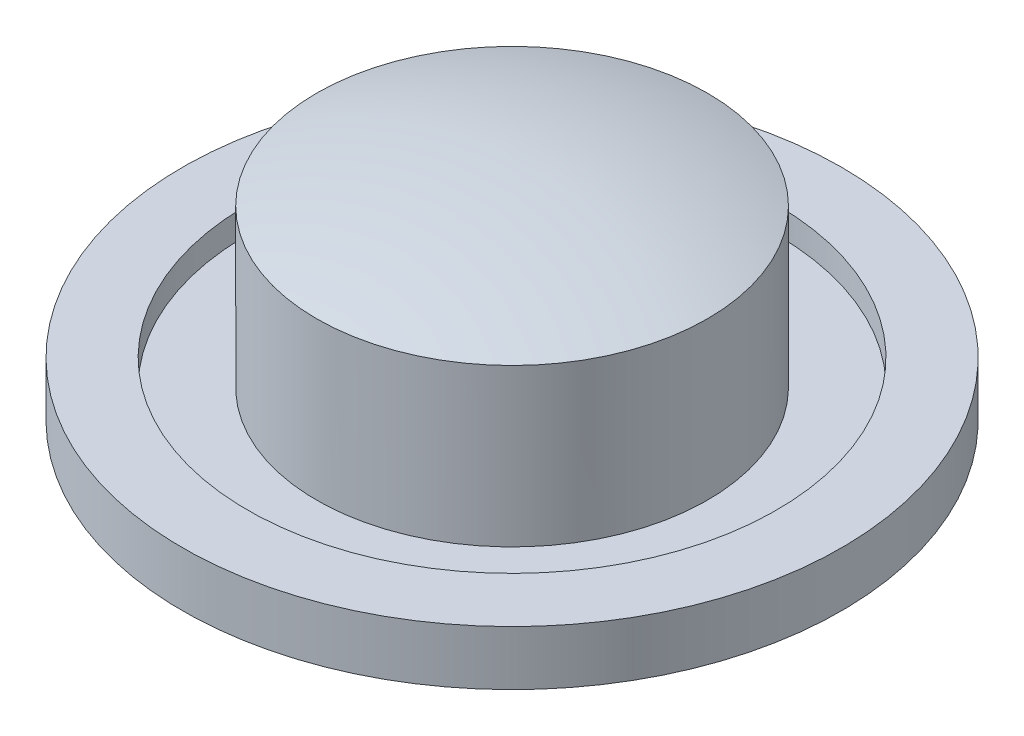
ISO-10303-21;
HEADER;
FILE_DESCRIPTION(('STEP AP214'),'2;1');
FILE_NAME('part.step','',(''),(''),'','','');
FILE_SCHEMA(('AUTOMOTIVE_DESIGN { 1 0 10303 214 1 1 1 1 }'));
ENDSEC;
DATA;
#1=APPLICATION_CONTEXT('core data for automotive mechanical design processes');
#2=APPLICATION_PROTOCOL_DEFINITION('international standard','automotive_design',2000,#1);
#3=PRODUCT_CONTEXT('',#1,'mechanical');
#4=PRODUCT('Part','Part','',(#3));
#5=PRODUCT_RELATED_PRODUCT_CATEGORY('part','',(#4));
#6=PRODUCT_DEFINITION_FORMATION('','',#4);
#7=PRODUCT_DEFINITION_CONTEXT('part definition',#1,'design');
#8=PRODUCT_DEFINITION('design','',#6,#7);
#9=PRODUCT_DEFINITION_SHAPE('','',#8);
#10=(LENGTH_UNIT() NAMED_UNIT(*) SI_UNIT(.MILLI.,.METRE.));
#11=(NAMED_UNIT(*) PLANE_ANGLE_UNIT() SI_UNIT($,.RADIAN.));
#12=(NAMED_UNIT(*) SI_UNIT($,.STERADIAN.) SOLID_ANGLE_UNIT());
#13=UNCERTAINTY_MEASURE_WITH_UNIT(LENGTH_MEASURE(1.E-05),#10,'distance_accuracy_value','');
#14=(GEOMETRIC_REPRESENTATION_CONTEXT(3) GLOBAL_UNCERTAINTY_ASSIGNED_CONTEXT((#13)) GLOBAL_UNIT_ASSIGNED_CONTEXT((#10,
#11,#12)) REPRESENTATION_CONTEXT('',''));
#15=CARTESIAN_POINT('',(0.,0.,0.));
#16=DIRECTION('',(0.,0.,1.));
#17=DIRECTION('',(1.,0.,0.));
#18=AXIS2_PLACEMENT_3D('',#15,#16,#17);
#19=CARTESIAN_POINT('',(0.,-77.1021167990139,0.));
#20=DIRECTION('',(0.,-1.,0.));
#21=DIRECTION('',(1.,0.,0.));
#22=AXIS2_PLACEMENT_3D('',#19,#20,#21);
#23=SPHERICAL_SURFACE('',#22,120.940726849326);
#24=CARTESIAN_POINT('',(0.,37.3012734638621,0.));
#25=DIRECTION('',(0.,-1.,0.));
#26=DIRECTION('',(0.,0.,-1.));
#27=AXIS2_PLACEMENT_3D('',#24,#25,#26);
#28=CIRCLE('',#27,39.2240195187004);
#29=CARTESIAN_POINT('',(0.,37.3012734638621,-39.2240195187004));
#30=VERTEX_POINT('',#29);
#31=EDGE_CURVE('E10',#30,#30,#28,.T.);
#32=ORIENTED_EDGE('',*,*,#31,.F.);
#33=EDGE_LOOP('',(#32));
#34=FACE_BOUND('',#33,.T.);
#35=ADVANCED_FACE('F33',(#34),#23,.T.);
#36=CARTESIAN_POINT('',(0.,0.,0.));
#37=DIRECTION('',(0.,-1.,0.));
#38=DIRECTION('',(0.,0.,-1.));
#39=AXIS2_PLACEMENT_3D('',#36,#37,#38);
#40=CYLINDRICAL_SURFACE('',#39,39.2240195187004);
#41=ORIENTED_EDGE('',*,*,#31,.T.);
#42=EDGE_LOOP('',(#41));
#43=FACE_BOUND('',#42,.T.);
#44=CARTESIAN_POINT('',(0.,5.76823816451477,0.));
#45=DIRECTION('',(0.,-1.,0.));
#46=DIRECTION('',(0.,0.,-1.));
#47=AXIS2_PLACEMENT_3D('',#44,#45,#46);
#48=CIRCLE('',#47,39.2240195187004);
#49=CARTESIAN_POINT('',(0.,5.76823816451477,-39.2240195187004));
#50=VERTEX_POINT('',#49);
#51=EDGE_CURVE('E39',#50,#50,#48,.T.);
#52=ORIENTED_EDGE('',*,*,#51,.F.);
#53=EDGE_LOOP('',(#52));
#54=FACE_BOUND('',#53,.T.);
#55=ADVANCED_FACE('F75',(#43,#54),#40,.T.);
#56=CARTESIAN_POINT('',(39.2240195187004,5.76823816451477,0.));
#57=DIRECTION('',(0.,1.,0.));
#58=DIRECTION('',(0.,0.,1.));
#59=AXIS2_PLACEMENT_3D('',#56,#57,#58);
#60=PLANE('',#59);
#61=ORIENTED_EDGE('',*,*,#51,.T.);
#62=EDGE_LOOP('',(#61));
#63=FACE_BOUND('',#62,.T.);
#64=CARTESIAN_POINT('',(0.,5.76823816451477,0.));
#65=DIRECTION('',(0.,-1.,0.));
#66=DIRECTION('',(0.,0.,-1.));
#67=AXIS2_PLACEMENT_3D('',#64,#65,#66);
#68=CIRCLE('',#67,53.0677911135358);
#69=CARTESIAN_POINT('',(0.,5.76823816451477,-53.0677911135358));
#70=VERTEX_POINT('',#69);
#71=EDGE_CURVE('E43',#70,#70,#68,.T.);
#72=ORIENTED_EDGE('',*,*,#71,.F.);
#73=EDGE_LOOP('',(#72));
#74=FACE_BOUND('',#73,.T.);
#75=ADVANCED_FACE('F80',(#63,#74),#60,.T.);
#76=CARTESIAN_POINT('',(0.,0.,0.));
#77=DIRECTION('',(0.,-1.,0.));
#78=DIRECTION('',(0.,0.,-1.));
#79=AXIS2_PLACEMENT_3D('',#76,#77,#78);
#80=CYLINDRICAL_SURFACE('',#79,53.0677911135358);
#81=ORIENTED_EDGE('',*,*,#71,.T.);
#82=EDGE_LOOP('',(#81));
#83=FACE_BOUND('',#82,.T.);
#84=CARTESIAN_POINT('',(0.,10.959652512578,0.));
#85=DIRECTION('',(0.,-1.,0.));
#86=DIRECTION('',(0.,0.,-1.));
#87=AXIS2_PLACEMENT_3D('',#84,#85,#86);
#88=CIRCLE('',#87,53.0677911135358);
#89=CARTESIAN_POINT('',(0.,10.959652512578,-53.0677911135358));
#90=VERTEX_POINT('',#89);
#91=EDGE_CURVE('E47',#90,#90,#88,.T.);
#92=ORIENTED_EDGE('',*,*,#91,.F.);
#93=EDGE_LOOP('',(#92));
#94=FACE_BOUND('',#93,.T.);
#95=ADVANCED_FACE('F71',(#83,#94),#80,.F.);
#96=CARTESIAN_POINT('',(53.0677911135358,10.959652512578,0.));
#97=DIRECTION('',(0.,1.,0.));
#98=DIRECTION('',(0.,0.,1.));
#99=AXIS2_PLACEMENT_3D('',#96,#97,#98);
#100=PLANE('',#99);
#101=ORIENTED_EDGE('',*,*,#91,.T.);
#102=EDGE_LOOP('',(#101));
#103=FACE_BOUND('',#102,.T.);
#104=CARTESIAN_POINT('',(0.,10.959652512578,0.));
#105=DIRECTION('',(0.,-1.,0.));
#106=DIRECTION('',(0.,0.,-1.));
#107=AXIS2_PLACEMENT_3D('',#104,#105,#106);
#108=CIRCLE('',#107,66.1424642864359);
#109=CARTESIAN_POINT('',(0.,10.959652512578,-66.1424642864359));
#110=VERTEX_POINT('',#109);
#111=EDGE_CURVE('E52',#110,#110,#108,.T.);
#112=ORIENTED_EDGE('',*,*,#111,.F.);
#113=EDGE_LOOP('',(#112));
#114=FACE_BOUND('',#113,.T.);
#115=ADVANCED_FACE('F63',(#103,#114),#100,.T.);
#116=CARTESIAN_POINT('',(0.,0.,0.));
#117=DIRECTION('',(0.,-1.,0.));
#118=DIRECTION('',(0.,0.,-1.));
#119=AXIS2_PLACEMENT_3D('',#116,#117,#118);
#120=CYLINDRICAL_SURFACE('',#119,66.1424642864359);
#121=ORIENTED_EDGE('',*,*,#111,.T.);
#122=EDGE_LOOP('',(#121));
#123=FACE_BOUND('',#122,.T.);
#124=CARTESIAN_POINT('',(0.,0.,0.));
#125=DIRECTION('',(0.,-1.,0.));
#126=DIRECTION('',(0.,0.,-1.));
#127=AXIS2_PLACEMENT_3D('',#124,#125,#126);
#128=CIRCLE('',#127,66.1424642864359);
#129=CARTESIAN_POINT('',(0.,0.,-66.1424642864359));
#130=VERTEX_POINT('',#129);
#131=EDGE_CURVE('E55',#130,#130,#128,.T.);
#132=ORIENTED_EDGE('',*,*,#131,.F.);
#133=EDGE_LOOP('',(#132));
#134=FACE_BOUND('',#133,.T.);
#135=ADVANCED_FACE('F61',(#123,#134),#120,.T.);
#136=CARTESIAN_POINT('',(66.1424642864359,0.,0.));
#137=DIRECTION('',(0.,-1.,0.));
#138=DIRECTION('',(0.,0.,-1.));
#139=AXIS2_PLACEMENT_3D('',#136,#137,#138);
#140=PLANE('',#139);
#141=ORIENTED_EDGE('',*,*,#131,.T.);
#142=EDGE_LOOP('',(#141));
#143=FACE_BOUND('',#142,.T.);
#144=ADVANCED_FACE('F59',(#143),#140,.T.);
#145=CLOSED_SHELL('',(#35,#55,#75,#95,#115,#135,#144));
#146=MANIFOLD_SOLID_BREP('B2',#145);
#147=ADVANCED_BREP_SHAPE_REPRESENTATION('',(#18,#146),#14);
#148=SHAPE_DEFINITION_REPRESENTATION(#9,#147);
ENDSEC;
END-ISO-10303-21;
